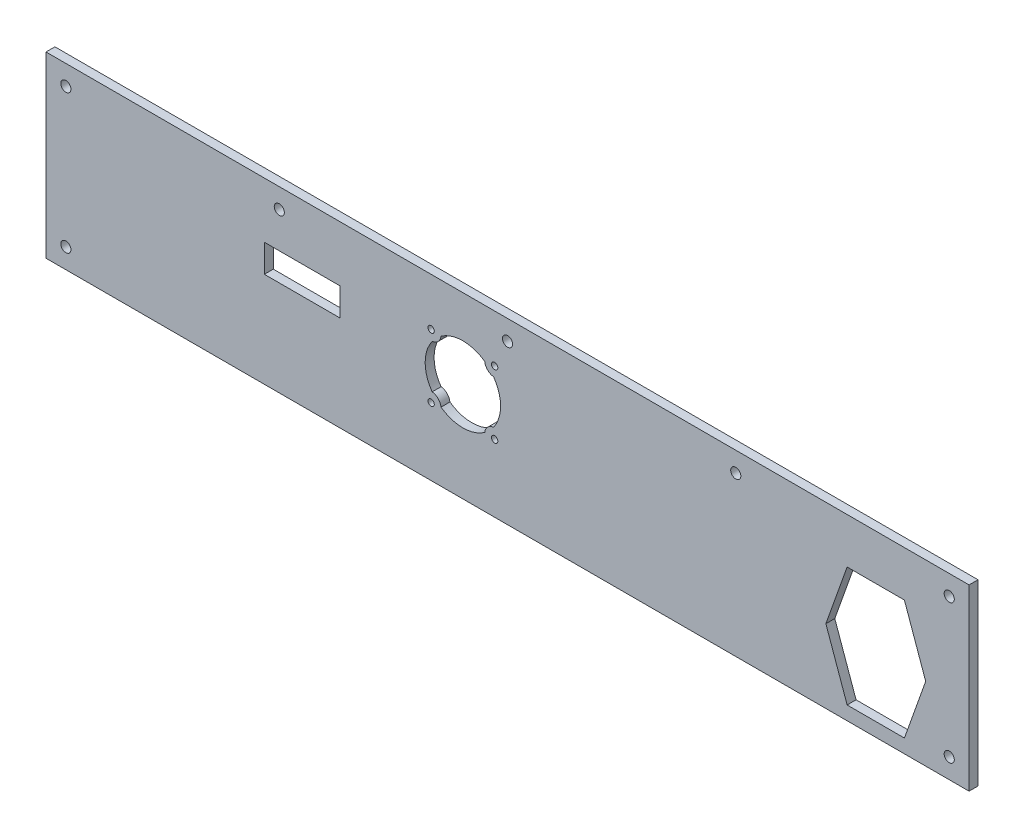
from build123d import *

# Parameters (mm, degrees)
SKETCH1_W           = 465
SKETCH1_H           = 90
SKETCH1_R           = 2.55
BOSS_EXTRUDE1_DEPTH = 2.2479
CUT_EXTRUDE1_REACH  = 238.857
SKETCH2_R           = 1.6
SKETCH2_W           = 38
SKETCH2_H           = 14


with BuildPart() as part:
    # Sketch1 → Boss-Extrude1 (new, symmetric)
    with BuildSketch(Plane.XY):
        Rectangle(SKETCH1_W, SKETCH1_H)
        with Locations((-222.5, 35)):
            Circle(SKETCH1_R, mode=Mode.SUBTRACT)
        with Locations((-222.5, -35)):
            Circle(SKETCH1_R, mode=Mode.SUBTRACT)
        with Locations((0, 35)):
            Circle(SKETCH1_R, mode=Mode.SUBTRACT)
        with Locations((-114.975, 35)):
            Circle(SKETCH1_R, mode=Mode.SUBTRACT)
        with Locations(Location((222.5, -35, 0), (0, 0, 180))):
            Circle(SKETCH1_R, mode=Mode.SUBTRACT)
        with Locations(Location((222.5, 35, 0), (0, 0, 180))):
            Circle(SKETCH1_R, mode=Mode.SUBTRACT)
        with Locations(Location((114.975, 35, 0), (0, 0, 180))):
            Circle(SKETCH1_R, mode=Mode.SUBTRACT)
    extrude(amount=BOSS_EXTRUDE1_DEPTH, both=True)

    # Sketch2 → Cut-Extrude1 (cut, up to next)
    with BuildSketch(Plane.XY.offset(2.2479), mode=Mode.PRIVATE) as cut_extrude1_sk1:
        with Locations((-6.5, 21)):
            Circle(SKETCH2_R)
    cut_extrude1_tool1 = extrude(cut_extrude1_sk1.sketch, amount=-CUT_EXTRUDE1_REACH, mode=Mode.PRIVATE) & part.part
    # Sketch2 → Cut-Extrude1 (cut, up to next)
    with BuildSketch(Plane.XY.offset(2.2479), mode=Mode.PRIVATE) as cut_extrude1_sk2:
        with Locations((-38.5, 21)):
            Circle(SKETCH2_R)
    cut_extrude1_tool2 = extrude(cut_extrude1_sk2.sketch, amount=-CUT_EXTRUDE1_REACH, mode=Mode.PRIVATE) & part.part
    # Sketch2 → Cut-Extrude1 (cut, up to next)
    with BuildSketch(Plane.XY.offset(2.2479), mode=Mode.PRIVATE) as cut_extrude1_sk3:
        with Locations((-38.5, -11)):
            Circle(SKETCH2_R)
    cut_extrude1_tool3 = extrude(cut_extrude1_sk3.sketch, amount=-CUT_EXTRUDE1_REACH, mode=Mode.PRIVATE) & part.part
    # Sketch2 → Cut-Extrude1 (cut, up to next)
    with BuildSketch(Plane.XY.offset(2.2479), mode=Mode.PRIVATE) as cut_extrude1_sk4:
        with Locations((-6.5, -11)):
            Circle(SKETCH2_R)
    cut_extrude1_tool4 = extrude(cut_extrude1_sk4.sketch, amount=-CUT_EXTRUDE1_REACH, mode=Mode.PRIVATE) & part.part
    # Sketch2 → Cut-Extrude1 (cut, up to next)
    with BuildSketch(Plane.XY.offset(2.2479), mode=Mode.PRIVATE) as cut_extrude1_sk5:
        with Locations((-103.5, 10)):
            Rectangle(SKETCH2_W, SKETCH2_H)
    cut_extrude1_tool5 = extrude(cut_extrude1_sk5.sketch, amount=-CUT_EXTRUDE1_REACH, mode=Mode.PRIVATE) & part.part
    # Sketch2 → Cut-Extrude1 (cut, up to next)
    with BuildSketch(Plane.XY.offset(2.2479), mode=Mode.PRIVATE) as cut_extrude1_sk6:
        Polygon((210.636873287, -8), (199.923313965, 22.1), (171.076686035, 22.1), (160.363126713, -8), (171.076686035, -38.1), (199.923313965, -38.1), align=None)
    cut_extrude1_tool6 = extrude(cut_extrude1_sk6.sketch, amount=-CUT_EXTRUDE1_REACH, mode=Mode.PRIVATE) & part.part
    # Sketch2 → Cut-Extrude1 (cut, up to next)
    with BuildSketch(Plane.XY.offset(2.2479), mode=Mode.PRIVATE) as cut_extrude1_sk7:
        with BuildLine():
            ThreePointArc((-33.527951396, -10.472048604), (-22.5, -14), (-11.472048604, -10.472048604))
            ThreePointArc((-11.472048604, -10.472048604), (-10.035533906, -7.464466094), (-7.027951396, -6.027951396))
            ThreePointArc((-7.027951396, -6.027951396), (-3.5, 5), (-7.027951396, 16.027951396))
            ThreePointArc((-7.027951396, 16.027951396), (-10.035533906, 17.464466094), (-11.472048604, 20.472048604))
            ThreePointArc((-11.472048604, 20.472048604), (-22.5, 24), (-33.527951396, 20.472048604))
            ThreePointArc((-33.527951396, 20.472048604), (-34.964466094, 17.464466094), (-37.972048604, 16.027951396))
            ThreePointArc((-37.972048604, 16.027951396), (-41.5, 5), (-37.972048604, -6.027951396))
            ThreePointArc((-37.972048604, -6.027951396), (-34.964466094, -7.464466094), (-33.527951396, -10.472048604))
        make_face()
    cut_extrude1_tool7 = extrude(cut_extrude1_sk7.sketch, amount=-CUT_EXTRUDE1_REACH, mode=Mode.PRIVATE) & part.part
    add(cut_extrude1_tool1.solids().sort_by_distance((-6.5, 21, 2.2479))[0], mode=Mode.SUBTRACT)
    add(cut_extrude1_tool2.solids().sort_by_distance((-38.5, 21, 2.2479))[0], mode=Mode.SUBTRACT)
    add(cut_extrude1_tool3.solids().sort_by_distance((-38.5, -11, 2.2479))[0], mode=Mode.SUBTRACT)
    add(cut_extrude1_tool4.solids().sort_by_distance((-6.5, -11, 2.2479))[0], mode=Mode.SUBTRACT)
    add(cut_extrude1_tool5.solids().sort_by_distance((-103.5, 10, 2.2479))[0], mode=Mode.SUBTRACT)
    add(cut_extrude1_tool6.solids().sort_by_distance((185.5, -8, 2.2479))[0], mode=Mode.SUBTRACT)
    add(cut_extrude1_tool7.solids().sort_by_distance((-22.5, 5, 2.2479))[0], mode=Mode.SUBTRACT)


solid = part.part
